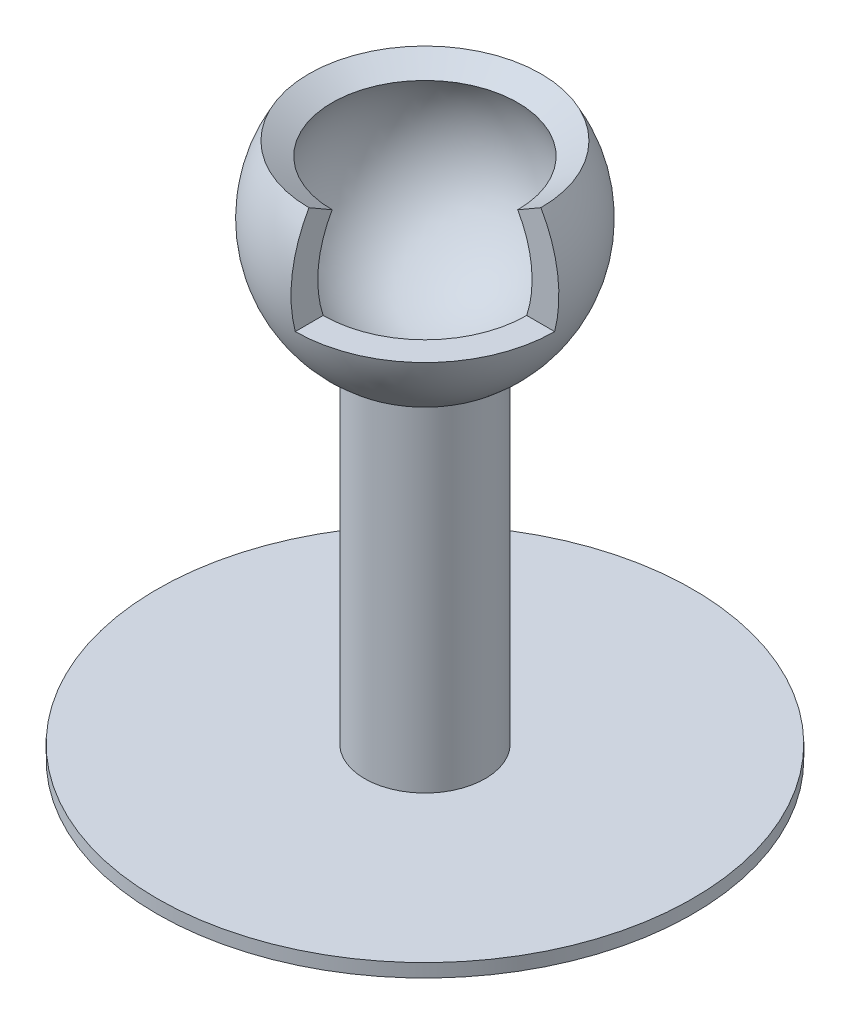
from build123d import *

# Parameters (mm, degrees)
ESQUISSE2_R             = 40
BOSS_EXTRU_2_DEPTH      = 2
BOSS_EXTRU_3_REACH      = 98.354
BOSS_EXTRU_3_END_RADIUS = 20
ESQUISSE3_R             = 9
ESQUISSE4_W             = 27.394765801
ESQUISSE4_H             = 26.309824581
ENL_V_MAT_EXTRU_1_DEPTH = 15


with BuildPart() as part:
    # Esquisse2 → Boss.-Extru.2 (new body)
    with BuildSketch(Plane(origin=(0, -70, 0), x_dir=(-1, 0, 0), z_dir=(0, 1, 0))):
        with Locations(Location((0, 0, 0), (0, 0, 90))):
            Circle(ESQUISSE2_R)
    extrude(amount=BOSS_EXTRU_2_DEPTH)



with BuildPart() as body_2:
    # Esquisse1 → R_volution1 (revolve)
    with BuildSketch(Plane.XY, mode=Mode.PRIVATE) as r_volution1_sk:
        with BuildLine():
            Line((0, -16), (0, -20))
            ThreePointArc((0, -20), (17.320508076, -10), (17.320508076, 10))
            Line((17.320508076, 10), (13.856406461, 8))
            ThreePointArc((13.856406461, 8), (13.856406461, -8), (0, -16))
        make_face()
    revolve(r_volution1_sk.sketch.rotate(Axis((0, 21.411150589, 0), (0, -1, 0)), 90), axis=Axis((0, 21.411150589, 0), (0, -1, 0)))


with BuildPart() as part_1:
    add(part.part)

    add(body_2.part)  # Boss.-Extru.3 merges body 2
    # Boss.-Extru.3: up to this sphere (the profile starts outside it)
    boss_extru_3_end = Location((0, 0, 0)) * Sphere(BOSS_EXTRU_3_END_RADIUS, mode=Mode.PRIVATE)
    # Esquisse3 → Boss.-Extru.3 (add, up to the surface)
    with BuildSketch(Plane(origin=(0, -68, 0), x_dir=(1, 0, 0), z_dir=(0, 1, 0)), mode=Mode.PRIVATE) as boss_extru_3_sk1:
        with Locations(Location((0, 0, 0), (0, 0, 180))):
            Circle(ESQUISSE3_R)
    boss_extru_3_tool1 = extrude(boss_extru_3_sk1.sketch, amount=BOSS_EXTRU_3_REACH, mode=Mode.PRIVATE) - boss_extru_3_end
    add(boss_extru_3_tool1.solids().sort_by_distance((0, -68, 0))[0])

    # Esquisse4 → Enl_v. mat.-Extru.1 (cut)
    with BuildSketch(Plane.XZ.offset(-10)):
        with Locations((13.697382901, 13.154912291)):
            Rectangle(ESQUISSE4_W, ESQUISSE4_H)
    extrude(amount=ENL_V_MAT_EXTRU_1_DEPTH, mode=Mode.SUBTRACT)


solid = part_1.part
